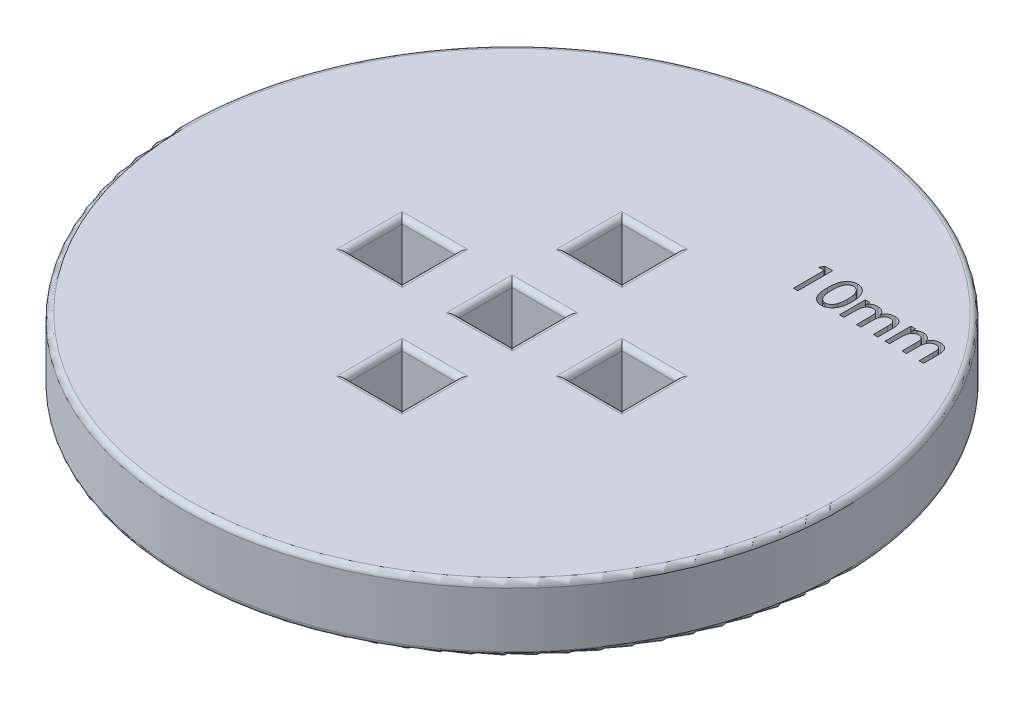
from build123d import *

# Parameters (mm, degrees)
SKETCH1_R           = 30
BOSS_EXTRUDE1_DEPTH = 6
SKETCH2_W           = 5
SKETCH2_H           = 5
CUT_EXTRUDE1_DEPTH  = 3
FILLET1_R           = 0.5
SKETCH4_W           = 5
SKETCH4_H           = 5
CUT_EXTRUDE2_DEPTH  = 3
FILLET2_R           = 0.5
FILLET3_R           = 0.5
CUT_EXTRUDE3_DEPTH  = 3


with BuildPart() as part:
    # Sketch1 → Boss-Extrude1 (new body)
    with BuildSketch(Plane(origin=(0, 0, 0), x_dir=(1, 0, 0), z_dir=(0, 1, 0))):
        with Locations(Location((0, 0, 0), (0, 0, 270))):
            Circle(SKETCH1_R)
    extrude(amount=BOSS_EXTRUDE1_DEPTH)

    # Sketch2 → Cut-Extrude1 (cut)
    with BuildSketch(Plane(origin=(0, 6, 0), x_dir=(1, 0, 0), z_dir=(0, 1, 0))):
        with Locations((0, -10)):
            Rectangle(SKETCH2_W, SKETCH2_H)
        with Locations((-10, 0)):
            Rectangle(SKETCH2_W, SKETCH2_H)
        Rectangle(SKETCH2_W, SKETCH2_H)
        with Locations((0, 10)):
            Rectangle(SKETCH2_W, SKETCH2_H)
        with Locations((10, 0)):
            Rectangle(SKETCH2_W, SKETCH2_H)
    extrude(amount=-CUT_EXTRUDE1_DEPTH, mode=Mode.SUBTRACT)

    # Fillet1
    fillet1_edges = [part.edges().sort_by_distance(p)[0] for p in [
        (2.5, 6, 0),
        (0, 6, 2.5),
        (-12.5, 6, 0),
        (-10, 6, 2.5),
        (-7.5, 6, 0),
        (-10, 6, -2.5),
    ]]
    fillet(fillet1_edges, radius=FILLET1_R)

    # Sketch4 → Cut-Extrude2 (cut)
    with BuildSketch(Plane(origin=(0, 0, 0), x_dir=(-1, 0, 0), z_dir=(0, -1, 0))):
        Rectangle(SKETCH4_W, SKETCH4_H)
        with Locations((0, -10)):
            Rectangle(SKETCH4_W, SKETCH4_H)
        with Locations((10, 0)):
            Rectangle(SKETCH4_W, SKETCH4_H)
        with Locations((-10, 0)):
            Rectangle(SKETCH4_W, SKETCH4_H)
        with Locations((0, 10)):
            Rectangle(SKETCH4_W, SKETCH4_H)
    extrude(amount=-CUT_EXTRUDE2_DEPTH, mode=Mode.SUBTRACT)

    # Fillet2
    fillet2_edges = [part.edges().sort_by_distance(p)[0] for p in [
        (-2.5, 0, 0),
        (0, 0, -2.5),
        (2.5, 0, 0),
        (0, 0, 2.5),
        (-2.5, 0, 10),
        (0, 0, 7.5),
        (2.5, 0, 10),
        (0, 0, 12.5),
        (-12.5, 0, 0),
        (-10, 0, -2.5),
        (-7.5, 0, 0),
        (-10, 0, 2.5),
        (7.5, 0, 0),
        (10, 0, -2.5),
        (12.5, 0, 0),
        (10, 0, 2.5),
        (2.5, 0, -10),
        (0, 0, -7.5),
        (-2.5, 0, -10),
        (0, 0, -12.5),
        (0, 0, -30),
    ]]
    fillet(fillet2_edges, radius=FILLET2_R)

    # Fillet3
    fillet3_edges = [part.edges().sort_by_distance(p)[0] for p in [
        (0, 6, -30),
        (0, 6, 7.5),
        (-2.5, 6, 10),
        (0, 6, 12.5),
        (2.5, 6, 10),
        (-2.5, 6, 0.25),
        (0.25, 6, -2.5),
        (0, 6, -12.5),
        (-2.5, 6, -10),
        (0, 6, -7.5),
        (2.5, 6, -10),
        (10, 6, 2.5),
        (12.5, 6, 0),
        (10, 6, -2.5),
        (7.5, 6, 0),
    ]]
    fillet(fillet3_edges, radius=FILLET3_R)

    # Sketch5 → Cut-Extrude3 (cut)
    # profile 1 of 4: a face of its own
    with BuildSketch(Plane(origin=(0, 6, 0), x_dir=(1, 0, 0), z_dir=(0, 1, 0))):
        Polygon((10.572165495, 17.93214623), (11.26288064, 17.93214623), (11.26288064, 14.75714623), (10.855829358, 14.75714623), (10.855829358, 17.565800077), (10.367367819, 17.565800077), align=None)
    # profile 2 of 4: a face of its own
    with BuildSketch(Plane(origin=(0, 6, 0), x_dir=(1, 0, 0), z_dir=(0, 1, 0))):
        with BuildLine():
            add(Edge.make_bspline(
                [(12.361919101, 16.343374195), (12.362222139, 16.39383784), (12.362810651, 16.491840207), (12.369152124, 16.634408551), (12.380091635, 16.768230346), (12.394143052, 16.893309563), (12.413582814, 17.009732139), (12.435825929, 17.117555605), (12.463206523, 17.216793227), (12.495187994, 17.307622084), (12.531096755, 17.391655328), (12.570578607, 17.469945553), (12.613383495, 17.543486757), (12.659222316, 17.612253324), (12.710262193, 17.674713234), (12.763506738, 17.733005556), (12.820955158, 17.78599238), (12.882080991, 17.833408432), (12.945312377, 17.876277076), (13.011396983, 17.912409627), (13.0788036, 17.943884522), (13.148391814, 17.96934498), (13.219657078, 17.989122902), (13.292854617, 18.002934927), (13.367636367, 18.012446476), (13.418314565, 18.013185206), (13.443785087, 18.013556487)],
                knots=[0, 0, 0, 0, 1.622528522, 3.151013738, 4.587225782, 5.939257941, 7.196658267, 8.381214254, 9.47772444, 10.503964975, 11.475138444, 12.414102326, 13.321377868, 14.209997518, 15.068075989, 15.912287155, 16.746865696, 17.577313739, 18.397854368, 19.200328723, 19.996378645, 20.787862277, 21.580050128, 22.371504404, 23.181529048, 24, 24, 24, 24], degree=3))
            add(Edge.make_bspline(
                [(13.443785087, 18.013556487), (13.471570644, 18.012824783), (13.5264144, 18.01138053), (13.607805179, 18.003520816), (13.686467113, 17.987641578), (13.763479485, 17.967728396), (13.837594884, 17.940506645), (13.910281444, 17.90920288), (13.979301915, 17.869553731), (14.047010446, 17.826182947), (14.11108551, 17.776167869), (14.172370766, 17.721822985), (14.22895548, 17.661293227), (14.282902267, 17.596661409), (14.331443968, 17.525396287), (14.377654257, 17.449993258), (14.418570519, 17.36857443), (14.457391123, 17.282580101), (14.490759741, 17.189723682), (14.520961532, 17.09053545), (14.545436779, 16.983779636), (14.565739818, 16.869788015), (14.581386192, 16.748368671), (14.592941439, 16.619810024), (14.598974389, 16.483991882), (14.600115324, 16.391080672), (14.600701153, 16.343374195)],
                knots=[0, 0, 0, 0, 0.875057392, 1.727207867, 2.570264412, 3.399251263, 4.229017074, 5.053828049, 5.887584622, 6.731829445, 7.583639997, 8.443960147, 9.308026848, 10.190032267, 11.091770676, 12.020167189, 12.972467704, 13.958579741, 14.989078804, 16.076606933, 17.221320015, 18.435081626, 19.720875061, 21.074561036, 22.497895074, 24, 24, 24, 24], degree=3))
            add(Edge.make_bspline(
                [(14.600701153, 16.343374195), (14.600109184, 16.295880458), (14.598956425, 16.203394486), (14.593010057, 16.068201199), (14.581155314, 15.940341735), (14.566559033, 15.819457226), (14.546085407, 15.705914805), (14.521156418, 15.599654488), (14.493200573, 15.500117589), (14.459025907, 15.408176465), (14.421184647, 15.322283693), (14.380129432, 15.241592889), (14.334913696, 15.165945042), (14.28484831, 15.09616092), (14.232318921, 15.0300447), (14.175043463, 14.969894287), (14.114065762, 14.914563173), (14.049533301, 14.864756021), (13.982184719, 14.819839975), (13.911597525, 14.781925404), (13.839551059, 14.748272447), (13.764436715, 14.72276848), (13.687777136, 14.701002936), (13.608281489, 14.686943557), (13.526687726, 14.677635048), (13.471584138, 14.676372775), (13.443785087, 14.675735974)],
                knots=[0, 0, 0, 0, 1.496607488, 2.914388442, 4.262485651, 5.541812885, 6.749953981, 7.895567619, 8.980172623, 10.005210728, 10.983286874, 11.936336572, 12.856292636, 13.757107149, 14.640766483, 15.514956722, 16.370989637, 17.232841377, 18.081413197, 18.918442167, 19.755471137, 20.583656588, 21.41504191, 22.264086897, 23.124254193, 24, 24, 24, 24], degree=3))
            add(Edge.make_bspline(
                [(13.443785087, 14.675735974), (13.418110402, 14.676172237), (13.367259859, 14.677036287), (13.292170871, 14.685510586), (13.219023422, 14.699574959), (13.148032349, 14.719286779), (13.078698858, 14.744313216), (13.011323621, 14.774629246), (12.946349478, 14.811338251), (12.883156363, 14.852583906), (12.822662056, 14.899497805), (12.766315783, 14.952522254), (12.712762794, 15.010390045), (12.663064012, 15.073725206), (12.616121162, 15.142118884), (12.573802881, 15.216215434), (12.534348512, 15.295223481), (12.497769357, 15.379751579), (12.464741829, 15.471268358), (12.4383994, 15.571564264), (12.413558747, 15.679544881), (12.395329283, 15.796302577), (12.379512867, 15.920956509), (12.370336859, 16.054315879), (12.362495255, 16.195938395), (12.362114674, 16.29332789), (12.361919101, 16.343374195)],
                knots=[0, 0, 0, 0, 0.82614074, 1.636230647, 2.42850654, 3.22151677, 4.005075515, 4.799112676, 5.596456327, 6.404618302, 7.226350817, 8.05679228, 8.892237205, 9.761873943, 10.645770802, 11.559890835, 12.505927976, 13.487073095, 14.523090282, 15.633895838, 16.822583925, 18.088023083, 19.435493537, 20.865857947, 22.389433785, 24, 24, 24, 24], degree=3))
        make_face()
        with BuildLine():
            add(Edge.make_bspline(
                [(12.768970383, 16.34464623), (12.769133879, 16.302028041), (12.769450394, 16.219522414), (12.77415014, 16.100133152), (12.78084131, 15.988963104), (12.790850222, 15.88604241), (12.804196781, 15.791218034), (12.819993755, 15.704620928), (12.838004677, 15.626085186), (12.859963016, 15.555481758), (12.884276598, 15.491151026), (12.911310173, 15.431926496), (12.939380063, 15.376466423), (12.970999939, 15.325870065), (13.004486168, 15.279445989), (13.040443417, 15.237370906), (13.077588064, 15.198722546), (13.130575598, 15.15580719), (13.198468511, 15.11093923), (13.282749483, 15.072032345), (13.367665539, 15.046349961), (13.424955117, 15.043495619), (13.453325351, 15.042082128)],
                knots=[0, 0, 0, 0, 1.564601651, 3.028951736, 4.386019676, 5.653114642, 6.824348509, 7.900668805, 8.88431448, 9.780488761, 10.613163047, 11.407444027, 12.169849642, 12.89344098, 13.595615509, 14.26934431, 14.924332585, 15.560171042, 16.769153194, 17.901006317, 18.960562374, 20, 20, 20, 20], degree=3))
            add(Edge.make_bspline(
                [(13.453325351, 15.042082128), (13.485474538, 15.043764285), (13.549572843, 15.04711813), (13.643974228, 15.071538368), (13.734489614, 15.112524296), (13.806209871, 15.15882913), (13.860397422, 15.203866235), (13.899530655, 15.242206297), (13.935600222, 15.285010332), (13.96965107, 15.331626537), (14.000439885, 15.382817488), (14.030127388, 15.437421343), (14.05597601, 15.496748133), (14.070915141, 15.538089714), (14.07853068, 15.55916446)],
                knots=[0, 0, 0, 0, 1.331887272, 2.655486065, 4.012646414, 5.436183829, 6.178803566, 6.930724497, 7.703763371, 8.496530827, 9.320959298, 10.178042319, 11.071218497, 12, 12, 12, 12], degree=3))
            add(Edge.make_bspline(
                [(14.07853068, 15.55916446), (14.087705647, 15.586853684), (14.106409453, 15.643300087), (14.129842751, 15.731183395), (14.149242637, 15.823399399), (14.16594702, 15.919456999), (14.178630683, 16.019840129), (14.187397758, 16.124452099), (14.192426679, 16.233293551), (14.193237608, 16.307116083), (14.19364987, 16.34464623)],
                knots=[0, 0, 0, 0, 0.877617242, 1.789083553, 2.735016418, 3.71249782, 4.722174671, 5.778575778, 6.870664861, 8, 8, 8, 8], degree=3))
            add(Edge.make_bspline(
                [(14.19364987, 16.34464623), (14.193551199, 16.382180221), (14.193358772, 16.455377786), (14.187639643, 16.562447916), (14.180722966, 16.664364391), (14.168790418, 16.760792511), (14.155436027, 16.852213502), (14.137118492, 16.937981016), (14.117471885, 17.018951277), (14.09292755, 17.094124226), (14.06609327, 17.164258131), (14.037790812, 17.229586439), (14.007188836, 17.290161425), (13.973472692, 17.345223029), (13.937886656, 17.39567953), (13.90029796, 17.441227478), (13.860146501, 17.481610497), (13.804013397, 17.527143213), (13.73165078, 17.574532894), (13.64116737, 17.617062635), (13.547734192, 17.642135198), (13.484630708, 17.645527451), (13.453325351, 17.647210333)],
                knots=[0, 0, 0, 0, 1.353201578, 2.638969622, 3.865559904, 5.035676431, 6.141732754, 7.195734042, 8.19695873, 9.144657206, 10.044788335, 10.904062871, 11.710933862, 12.489720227, 13.229995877, 13.935715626, 14.616825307, 15.279494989, 16.538995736, 17.725922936, 18.871840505, 20, 20, 20, 20], degree=3))
            add(Edge.make_bspline(
                [(13.453325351, 17.647210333), (13.424963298, 17.645769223), (13.367485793, 17.642848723), (13.282440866, 17.617523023), (13.198463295, 17.578307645), (13.131025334, 17.533408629), (13.078476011, 17.490538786), (13.040824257, 17.452769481), (13.00603877, 17.410456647), (12.972469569, 17.364406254), (12.941817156, 17.313477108), (12.91204555, 17.258598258), (12.885814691, 17.198863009), (12.861146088, 17.134482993), (12.839419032, 17.063750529), (12.820629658, 16.98533465), (12.80383908, 16.898833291), (12.791738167, 16.803817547), (12.781565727, 16.700740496), (12.773952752, 16.589396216), (12.7695077, 16.469766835), (12.769153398, 16.387263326), (12.768970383, 16.34464623)],
                knots=[0, 0, 0, 0, 1.039778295, 2.107176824, 3.232337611, 4.43520669, 5.071253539, 5.720927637, 6.389866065, 7.081397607, 7.811854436, 8.571243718, 9.372887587, 10.205834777, 11.102302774, 12.088086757, 13.166194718, 14.33675119, 15.604261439, 16.970055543, 18.43488556, 20, 20, 20, 20], degree=3))
        make_face(mode=Mode.SUBTRACT)
    # profile 3 of 4: a face of its own
    with BuildSketch(Plane(origin=(0, 6, 0), x_dir=(1, 0, 0), z_dir=(0, 1, 0))):
        with BuildLine():
            Line((15.048457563, 17.118043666), (15.455508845, 17.118043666))
            Line((15.455508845, 17.118043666), (15.455508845, 16.721804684))
            add(Edge.make_bspline(
                [(15.455508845, 16.721804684), (15.459418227, 16.738855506), (15.467046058, 16.772124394), (15.483842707, 16.81960043), (15.504362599, 16.86350194), (15.527717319, 16.904877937), (15.556097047, 16.942123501), (15.587140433, 16.977123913), (15.623080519, 17.007533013), (15.649118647, 17.025202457), (15.662214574, 17.034089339)],
                knots=[0, 0, 0, 0, 1.08898891, 2.124791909, 3.129224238, 4.105481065, 5.077441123, 6.040388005, 7.014409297, 8, 8, 8, 8], degree=3))
            add(Edge.make_bspline(
                [(15.662214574, 17.034089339), (15.701633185, 17.053399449), (15.779463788, 17.091526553), (15.902560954, 17.129399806), (16.027100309, 17.154633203), (16.111118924, 17.15737493), (16.153220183, 17.158748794)],
                knots=[0, 0, 0, 0, 1.028471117, 2.030678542, 3.013184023, 4, 4, 4, 4], degree=3))
            add(Edge.make_bspline(
                [(16.153220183, 17.158748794), (16.184227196, 17.15795911), (16.245716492, 17.156393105), (16.336763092, 17.141793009), (16.425188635, 17.118323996), (16.510159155, 17.085933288), (16.589427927, 17.046190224), (16.661802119, 17.001282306), (16.725508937, 16.950372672), (16.781367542, 16.89463088), (16.827782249, 16.832136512), (16.864383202, 16.763704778), (16.890348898, 16.688482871), (16.899184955, 16.635693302), (16.903720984, 16.608593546)],
                knots=[0, 0, 0, 0, 1.099015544, 2.179432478, 3.260947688, 4.338981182, 5.398181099, 6.40160478, 7.353922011, 8.284349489, 9.192639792, 10.104191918, 11.026778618, 12, 12, 12, 12], degree=3))
            add(Edge.make_bspline(
                [(16.903720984, 16.608593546), (16.911067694, 16.629477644), (16.925595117, 16.670773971), (16.952160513, 16.730268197), (16.98434075, 16.785798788), (17.020732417, 16.838107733), (17.061343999, 16.887517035), (17.107623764, 16.932306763), (17.157200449, 16.9749765), (17.211871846, 17.012380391), (17.268739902, 17.046692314), (17.327417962, 17.076604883), (17.387022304, 17.102240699), (17.44803325, 17.122384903), (17.509667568, 17.13933943), (17.572877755, 17.150743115), (17.637136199, 17.156952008), (17.68028617, 17.15814872), (17.701923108, 17.158748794)],
                knots=[0, 0, 0, 0, 1.024672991, 2.026193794, 3.01103273, 3.991165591, 4.973850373, 5.96628909, 6.969107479, 7.9982829, 9.028393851, 10.042340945, 11.044967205, 12.028827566, 13.014448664, 14.002022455, 14.998142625, 16, 16, 16, 16], degree=3))
            add(Edge.make_bspline(
                [(17.701923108, 17.158748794), (17.723990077, 17.158459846), (17.767372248, 17.157891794), (17.83129038, 17.151092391), (17.89320009, 17.141182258), (17.95300716, 17.126624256), (18.010495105, 17.107287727), (18.065939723, 17.084317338), (18.119614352, 17.057849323), (18.186720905, 17.016099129), (18.264949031, 16.957840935), (18.344323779, 16.873730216), (18.410848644, 16.780011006), (18.454071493, 16.692681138), (18.481609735, 16.616044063), (18.500112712, 16.551715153), (18.514982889, 16.480863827), (18.527852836, 16.403873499), (18.537079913, 16.32019488), (18.54390958, 16.230251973), (18.5486194, 16.133749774), (18.548935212, 16.067348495), (18.549098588, 16.032997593)],
                knots=[0, 0, 0, 0, 0.823429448, 1.618806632, 2.396867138, 3.162757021, 3.913573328, 4.658737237, 5.40200746, 6.144476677, 7.607081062, 9.028926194, 10.443018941, 11.88355177, 12.649646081, 13.481287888, 14.380074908, 15.350698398, 16.394246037, 17.521443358, 18.717785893, 20, 20, 20, 20], degree=3))
            Line((18.549098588, 16.032997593), (18.549098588, 14.75714623))
            Line((18.549098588, 14.75714623), (18.142047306, 14.75714623))
            Line((18.142047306, 14.75714623), (18.142047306, 16.031725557))
            add(Edge.make_bspline(
                [(18.142047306, 16.031725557), (18.141996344, 16.060136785), (18.141898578, 16.114640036), (18.139211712, 16.192673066), (18.1354376, 16.263498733), (18.130678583, 16.327183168), (18.123645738, 16.383819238), (18.11543837, 16.433475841), (18.106486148, 16.476198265), (18.091064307, 16.522902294), (18.06696895, 16.57395337), (18.029328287, 16.628477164), (17.983062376, 16.676470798), (17.928763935, 16.717706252), (17.867831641, 16.751916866), (17.799878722, 16.774989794), (17.726788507, 16.790433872), (17.67593116, 16.791733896), (17.649769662, 16.792402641)],
                knots=[0, 0, 0, 0, 1.305376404, 2.504195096, 3.587062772, 4.564309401, 5.437885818, 6.208191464, 6.877018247, 7.440755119, 8.464755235, 9.459136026, 10.471907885, 11.51427718, 12.582498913, 13.666986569, 14.799875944, 16, 16, 16, 16], degree=3))
            add(Edge.make_bspline(
                [(17.649769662, 16.792402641), (17.620619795, 16.790981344), (17.562250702, 16.78813537), (17.476046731, 16.767301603), (17.393289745, 16.731286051), (17.313854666, 16.683269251), (17.2409288, 16.622204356), (17.176335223, 16.549620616), (17.123043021, 16.464758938), (17.085409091, 16.385883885), (17.061113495, 16.313763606), (17.045772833, 16.249823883), (17.031460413, 16.177341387), (17.021427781, 16.095675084), (17.01202121, 16.005181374), (17.007085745, 15.905620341), (17.002867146, 15.797071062), (17.002496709, 15.721778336), (17.002303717, 15.682551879)],
                knots=[0, 0, 0, 0, 0.96585306, 1.934004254, 2.919496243, 3.947541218, 5.000269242, 6.060662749, 7.154254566, 8.311133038, 8.948925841, 9.673294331, 10.489200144, 11.396606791, 12.399336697, 13.504450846, 14.699853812, 16, 16, 16, 16], degree=3))
            Line((17.002303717, 15.682551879), (17.002303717, 14.75714623))
            Line((17.002303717, 14.75714623), (16.595252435, 14.75714623))
            Line((16.595252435, 14.75714623), (16.595252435, 15.954767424))
            add(Edge.make_bspline(
                [(16.595252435, 15.954767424), (16.595202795, 15.986782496), (16.59510777, 16.048068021), (16.592413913, 16.135851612), (16.588626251, 16.215578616), (16.583935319, 16.287103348), (16.576901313, 16.350314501), (16.568618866, 16.405252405), (16.559799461, 16.452223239), (16.544406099, 16.502836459), (16.52087332, 16.558302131), (16.483091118, 16.617070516), (16.436526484, 16.668899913), (16.381579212, 16.71261968), (16.319998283, 16.748426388), (16.252129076, 16.77405633), (16.178737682, 16.789712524), (16.127859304, 16.791489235), (16.101702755, 16.792402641)],
                knots=[0, 0, 0, 0, 1.376972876, 2.63589934, 3.777064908, 4.810071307, 5.718390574, 6.511518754, 7.200035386, 7.771255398, 8.78422519, 9.780850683, 10.762300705, 11.767731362, 12.789080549, 13.813681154, 14.876014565, 16, 16, 16, 16], degree=3))
            add(Edge.make_bspline(
                [(16.101702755, 16.792402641), (16.073826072, 16.790932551), (16.017815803, 16.787978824), (15.934729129, 16.767654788), (15.853703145, 16.732870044), (15.774893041, 16.68629383), (15.700930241, 16.62746128), (15.635916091, 16.555582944), (15.580544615, 16.472102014), (15.542256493, 16.393693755), (15.517082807, 16.323293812), (15.501001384, 16.262556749), (15.486078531, 16.195182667), (15.47509226, 16.120547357), (15.466207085, 16.039078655), (15.460017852, 15.950605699), (15.456170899, 15.855159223), (15.455734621, 15.789194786), (15.455508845, 15.755057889)],
                knots=[0, 0, 0, 0, 0.973948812, 1.956873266, 2.969584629, 4.045778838, 5.147278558, 6.259119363, 7.418022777, 8.637370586, 9.298195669, 10.027900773, 10.831491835, 11.708502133, 12.662464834, 13.694928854, 14.807115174, 16, 16, 16, 16], degree=3))
            Line((15.455508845, 15.755057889), (15.455508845, 14.75714623))
            Line((15.455508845, 14.75714623), (15.048457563, 14.75714623))
            Line((15.048457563, 14.75714623), (15.048457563, 17.118043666))
        make_face()
    # profile 4 of 4: a face of its own
    with BuildSketch(Plane(origin=(0, 6, 0), x_dir=(1, 0, 0), z_dir=(0, 1, 0))):
        with BuildLine():
            Line((19.20038064, 17.118043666), (19.607431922, 17.118043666))
            Line((19.607431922, 17.118043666), (19.607431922, 16.721804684))
            add(Edge.make_bspline(
                [(19.607431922, 16.721804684), (19.611341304, 16.738855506), (19.618969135, 16.772124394), (19.635765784, 16.81960043), (19.656285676, 16.86350194), (19.679640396, 16.904877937), (19.708020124, 16.942123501), (19.73906351, 16.977123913), (19.775003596, 17.007533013), (19.801041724, 17.025202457), (19.814137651, 17.034089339)],
                knots=[0, 0, 0, 0, 1.08898891, 2.124791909, 3.129224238, 4.105481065, 5.077441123, 6.040388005, 7.014409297, 8, 8, 8, 8], degree=3))
            add(Edge.make_bspline(
                [(19.814137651, 17.034089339), (19.853556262, 17.053399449), (19.931386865, 17.091526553), (20.054484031, 17.129399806), (20.179023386, 17.154633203), (20.263042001, 17.15737493), (20.30514326, 17.158748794)],
                knots=[0, 0, 0, 0, 1.028471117, 2.030678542, 3.013184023, 4, 4, 4, 4], degree=3))
            add(Edge.make_bspline(
                [(20.30514326, 17.158748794), (20.336150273, 17.15795911), (20.397639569, 17.156393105), (20.488686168, 17.141793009), (20.577111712, 17.118323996), (20.662082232, 17.085933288), (20.741351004, 17.046190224), (20.813725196, 17.001282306), (20.877432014, 16.950372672), (20.933290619, 16.89463088), (20.979705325, 16.832136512), (21.016306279, 16.763704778), (21.042271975, 16.688482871), (21.051108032, 16.635693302), (21.055644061, 16.608593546)],
                knots=[0, 0, 0, 0, 1.099015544, 2.179432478, 3.260947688, 4.338981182, 5.398181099, 6.40160478, 7.353922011, 8.284349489, 9.192639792, 10.104191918, 11.026778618, 12, 12, 12, 12], degree=3))
            add(Edge.make_bspline(
                [(21.055644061, 16.608593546), (21.062990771, 16.629477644), (21.077518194, 16.670773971), (21.104083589, 16.730268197), (21.136263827, 16.785798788), (21.172655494, 16.838107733), (21.213267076, 16.887517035), (21.259546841, 16.932306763), (21.309123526, 16.9749765), (21.363794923, 17.012380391), (21.420662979, 17.046692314), (21.479341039, 17.076604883), (21.538945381, 17.102240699), (21.599956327, 17.122384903), (21.661590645, 17.13933943), (21.724800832, 17.150743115), (21.789059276, 17.156952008), (21.832209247, 17.15814872), (21.853846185, 17.158748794)],
                knots=[0, 0, 0, 0, 1.024672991, 2.026193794, 3.01103273, 3.991165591, 4.973850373, 5.96628909, 6.969107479, 7.9982829, 9.028393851, 10.042340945, 11.044967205, 12.028827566, 13.014448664, 14.002022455, 14.998142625, 16, 16, 16, 16], degree=3))
            add(Edge.make_bspline(
                [(21.853846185, 17.158748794), (21.875913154, 17.158459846), (21.919295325, 17.157891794), (21.983213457, 17.151092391), (22.045123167, 17.141182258), (22.104930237, 17.126624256), (22.162418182, 17.107287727), (22.2178628, 17.084317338), (22.271537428, 17.057849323), (22.338643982, 17.016099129), (22.416872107, 16.957840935), (22.496246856, 16.873730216), (22.562771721, 16.780011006), (22.60599457, 16.692681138), (22.633532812, 16.616044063), (22.652035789, 16.551715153), (22.666905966, 16.480863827), (22.679775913, 16.403873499), (22.68900299, 16.32019488), (22.695832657, 16.230251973), (22.700542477, 16.133749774), (22.700858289, 16.067348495), (22.701021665, 16.032997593)],
                knots=[0, 0, 0, 0, 0.823429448, 1.618806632, 2.396867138, 3.162757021, 3.913573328, 4.658737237, 5.40200746, 6.144476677, 7.607081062, 9.028926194, 10.443018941, 11.88355177, 12.649646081, 13.481287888, 14.380074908, 15.350698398, 16.394246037, 17.521443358, 18.717785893, 20, 20, 20, 20], degree=3))
            Line((22.701021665, 16.032997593), (22.701021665, 14.75714623))
            Line((22.701021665, 14.75714623), (22.293970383, 14.75714623))
            Line((22.293970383, 14.75714623), (22.293970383, 16.031725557))
            add(Edge.make_bspline(
                [(22.293970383, 16.031725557), (22.293919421, 16.060136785), (22.293821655, 16.114640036), (22.291134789, 16.192673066), (22.287360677, 16.263498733), (22.28260166, 16.327183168), (22.275568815, 16.383819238), (22.267361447, 16.433475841), (22.258409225, 16.476198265), (22.242987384, 16.522902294), (22.218892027, 16.57395337), (22.181251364, 16.628477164), (22.134985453, 16.676470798), (22.080687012, 16.717706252), (22.019754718, 16.751916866), (21.951801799, 16.774989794), (21.878711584, 16.790433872), (21.827854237, 16.791733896), (21.801692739, 16.792402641)],
                knots=[0, 0, 0, 0, 1.305376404, 2.504195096, 3.587062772, 4.564309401, 5.437885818, 6.208191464, 6.877018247, 7.440755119, 8.464755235, 9.459136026, 10.471907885, 11.51427718, 12.582498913, 13.666986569, 14.799875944, 16, 16, 16, 16], degree=3))
            add(Edge.make_bspline(
                [(21.801692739, 16.792402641), (21.772542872, 16.790981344), (21.714173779, 16.78813537), (21.627969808, 16.767301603), (21.545212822, 16.731286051), (21.465777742, 16.683269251), (21.392851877, 16.622204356), (21.3282583, 16.549620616), (21.274966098, 16.464758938), (21.237332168, 16.385883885), (21.213036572, 16.313763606), (21.19769591, 16.249823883), (21.18338349, 16.177341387), (21.173350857, 16.095675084), (21.163944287, 16.005181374), (21.159008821, 15.905620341), (21.154790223, 15.797071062), (21.154419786, 15.721778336), (21.154226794, 15.682551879)],
                knots=[0, 0, 0, 0, 0.96585306, 1.934004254, 2.919496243, 3.947541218, 5.000269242, 6.060662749, 7.154254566, 8.311133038, 8.948925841, 9.673294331, 10.489200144, 11.396606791, 12.399336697, 13.504450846, 14.699853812, 16, 16, 16, 16], degree=3))
            Line((21.154226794, 15.682551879), (21.154226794, 14.75714623))
            Line((21.154226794, 14.75714623), (20.747175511, 14.75714623))
            Line((20.747175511, 14.75714623), (20.747175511, 15.954767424))
            add(Edge.make_bspline(
                [(20.747175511, 15.954767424), (20.747125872, 15.986782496), (20.747030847, 16.048068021), (20.74433699, 16.135851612), (20.740549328, 16.215578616), (20.735858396, 16.287103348), (20.72882439, 16.350314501), (20.720541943, 16.405252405), (20.711722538, 16.452223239), (20.696329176, 16.502836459), (20.672796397, 16.558302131), (20.635014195, 16.617070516), (20.58844956, 16.668899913), (20.533502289, 16.71261968), (20.47192136, 16.748426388), (20.404052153, 16.77405633), (20.330660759, 16.789712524), (20.279782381, 16.791489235), (20.253625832, 16.792402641)],
                knots=[0, 0, 0, 0, 1.376972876, 2.63589934, 3.777064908, 4.810071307, 5.718390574, 6.511518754, 7.200035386, 7.771255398, 8.78422519, 9.780850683, 10.762300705, 11.767731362, 12.789080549, 13.813681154, 14.876014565, 16, 16, 16, 16], degree=3))
            add(Edge.make_bspline(
                [(20.253625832, 16.792402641), (20.225749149, 16.790932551), (20.16973888, 16.787978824), (20.086652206, 16.767654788), (20.005626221, 16.732870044), (19.926816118, 16.68629383), (19.852853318, 16.62746128), (19.787839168, 16.555582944), (19.732467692, 16.472102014), (19.69417957, 16.393693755), (19.669005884, 16.323293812), (19.652924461, 16.262556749), (19.638001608, 16.195182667), (19.627015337, 16.120547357), (19.618130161, 16.039078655), (19.611940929, 15.950605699), (19.608093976, 15.855159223), (19.607657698, 15.789194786), (19.607431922, 15.755057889)],
                knots=[0, 0, 0, 0, 0.973948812, 1.956873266, 2.969584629, 4.045778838, 5.147278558, 6.259119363, 7.418022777, 8.637370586, 9.298195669, 10.027900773, 10.831491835, 11.708502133, 12.662464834, 13.694928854, 14.807115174, 16, 16, 16, 16], degree=3))
            Line((19.607431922, 15.755057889), (19.607431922, 14.75714623))
            Line((19.607431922, 14.75714623), (19.20038064, 14.75714623))
            Line((19.20038064, 14.75714623), (19.20038064, 17.118043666))
        make_face()
    extrude(amount=-CUT_EXTRUDE3_DEPTH, mode=Mode.SUBTRACT)


solid = part.part
